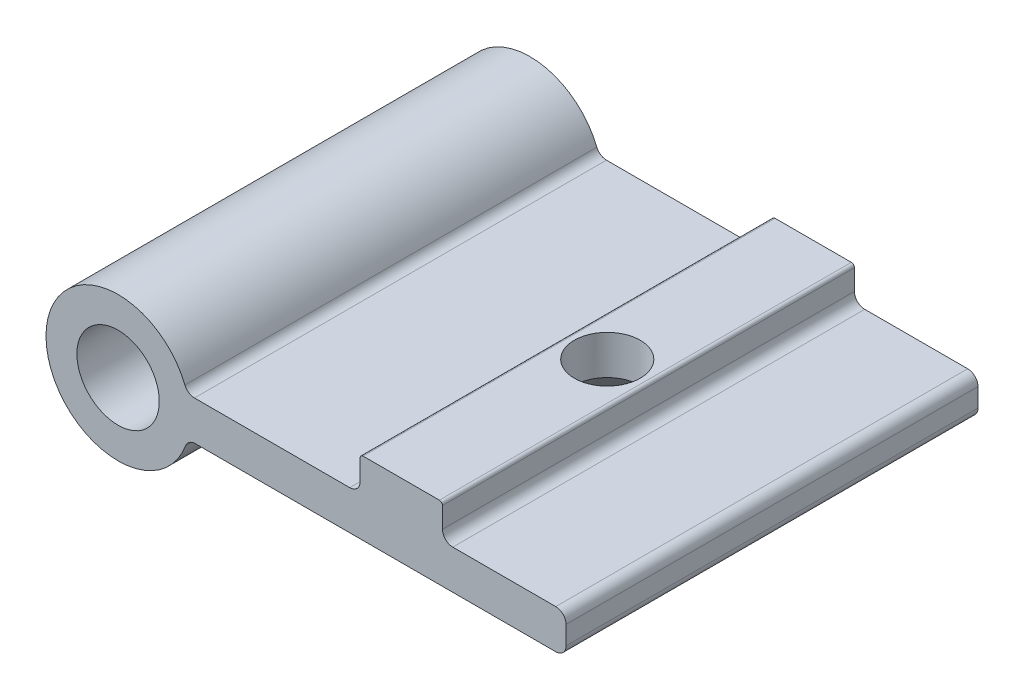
ISO-10303-21;
HEADER;
FILE_DESCRIPTION(('STEP AP214'),'2;1');
FILE_NAME('part.step','',(''),(''),'','','');
FILE_SCHEMA(('AUTOMOTIVE_DESIGN { 1 0 10303 214 1 1 1 1 }'));
ENDSEC;
DATA;
#1=APPLICATION_CONTEXT('core data for automotive mechanical design processes');
#2=APPLICATION_PROTOCOL_DEFINITION('international standard','automotive_design',2000,#1);
#3=PRODUCT_CONTEXT('',#1,'mechanical');
#4=PRODUCT('Part','Part','',(#3));
#5=PRODUCT_RELATED_PRODUCT_CATEGORY('part','',(#4));
#6=PRODUCT_DEFINITION_FORMATION('','',#4);
#7=PRODUCT_DEFINITION_CONTEXT('part definition',#1,'design');
#8=PRODUCT_DEFINITION('design','',#6,#7);
#9=PRODUCT_DEFINITION_SHAPE('','',#8);
#10=(LENGTH_UNIT() NAMED_UNIT(*) SI_UNIT(.MILLI.,.METRE.));
#11=(NAMED_UNIT(*) PLANE_ANGLE_UNIT() SI_UNIT($,.RADIAN.));
#12=(NAMED_UNIT(*) SI_UNIT($,.STERADIAN.) SOLID_ANGLE_UNIT());
#13=UNCERTAINTY_MEASURE_WITH_UNIT(LENGTH_MEASURE(1.E-05),#10,'distance_accuracy_value','');
#14=(GEOMETRIC_REPRESENTATION_CONTEXT(3) GLOBAL_UNCERTAINTY_ASSIGNED_CONTEXT((#13)) GLOBAL_UNIT_ASSIGNED_CONTEXT((#10,
#11,#12)) REPRESENTATION_CONTEXT('',''));
#15=CARTESIAN_POINT('',(0.,0.,0.));
#16=DIRECTION('',(0.,0.,1.));
#17=DIRECTION('',(1.,0.,0.));
#18=AXIS2_PLACEMENT_3D('',#15,#16,#17);
#19=CARTESIAN_POINT('',(31.2000000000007,5.00000000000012,20.));
#20=DIRECTION('',(0.,0.,-1.));
#21=DIRECTION('',(-1.,0.,0.));
#22=AXIS2_PLACEMENT_3D('',#19,#20,#21);
#23=CYLINDRICAL_SURFACE('',#22,0.299999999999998);
#24=CARTESIAN_POINT('',(31.2000000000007,5.00000000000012,20.));
#25=DIRECTION('',(0.,0.,-1.));
#26=DIRECTION('',(-1.,0.,0.));
#27=AXIS2_PLACEMENT_3D('',#24,#25,#26);
#28=CIRCLE('',#27,0.299999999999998);
#29=CARTESIAN_POINT('',(31.2000000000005,5.30000000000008,20.));
#30=VERTEX_POINT('',#29);
#31=CARTESIAN_POINT('',(31.5000000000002,5.00000000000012,20.0000000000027));
#32=VERTEX_POINT('',#31);
#33=EDGE_CURVE('E137',#30,#32,#28,.T.);
#34=ORIENTED_EDGE('',*,*,#33,.T.);
#35=DIRECTION('',(0.,0.,-1.));
#36=VECTOR('',#35,1.);
#37=CARTESIAN_POINT('',(31.5000000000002,5.00000000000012,20.0000000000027));
#38=LINE('',#37,#36);
#39=CARTESIAN_POINT('',(31.5000000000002,5.00000000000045,-19.9999999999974));
#40=VERTEX_POINT('',#39);
#41=EDGE_CURVE('E135',#40,#32,#38,.F.);
#42=ORIENTED_EDGE('',*,*,#41,.F.);
#43=CARTESIAN_POINT('',(31.2000000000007,5.00000000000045,-20.));
#44=DIRECTION('',(0.,0.,-1.));
#45=DIRECTION('',(-1.,0.,0.));
#46=AXIS2_PLACEMENT_3D('',#43,#44,#45);
#47=CIRCLE('',#46,0.299999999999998);
#48=CARTESIAN_POINT('',(31.2000000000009,5.30000000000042,-20.));
#49=VERTEX_POINT('',#48);
#50=EDGE_CURVE('E20',#40,#49,#47,.F.);
#51=ORIENTED_EDGE('',*,*,#50,.T.);
#52=DIRECTION('',(0.,0.,1.));
#53=VECTOR('',#52,1.);
#54=CARTESIAN_POINT('',(31.2000000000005,5.30000000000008,20.));
#55=LINE('',#54,#53);
#56=EDGE_CURVE('E132',#30,#49,#55,.F.);
#57=ORIENTED_EDGE('',*,*,#56,.F.);
#58=EDGE_LOOP('',(#34,#42,#51,#57));
#59=FACE_BOUND('',#58,.T.);
#60=ADVANCED_FACE('F16',(#59),#23,.T.);
#61=CARTESIAN_POINT('',(32.5000000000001,3.00000000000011,20.0000000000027));
#62=DIRECTION('',(0.,0.,-1.));
#63=DIRECTION('',(-1.,0.,0.));
#64=AXIS2_PLACEMENT_3D('',#61,#62,#63);
#65=CYLINDRICAL_SURFACE('',#64,0.999999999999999);
#66=CARTESIAN_POINT('',(32.5000000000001,3.00000000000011,20.0000000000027));
#67=DIRECTION('',(0.,0.,-1.));
#68=DIRECTION('',(-1.,0.,0.));
#69=AXIS2_PLACEMENT_3D('',#66,#67,#68);
#70=CIRCLE('',#69,0.999999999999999);
#71=CARTESIAN_POINT('',(31.4999999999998,3.00000000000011,20.0000000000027));
#72=VERTEX_POINT('',#71);
#73=CARTESIAN_POINT('',(32.5000000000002,2.00000000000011,20.0000000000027));
#74=VERTEX_POINT('',#73);
#75=EDGE_CURVE('E267',#72,#74,#70,.F.);
#76=ORIENTED_EDGE('',*,*,#75,.T.);
#77=DIRECTION('',(0.,0.,1.));
#78=VECTOR('',#77,1.);
#79=CARTESIAN_POINT('',(32.5000000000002,2.00000000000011,20.0000000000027));
#80=LINE('',#79,#78);
#81=CARTESIAN_POINT('',(32.5000000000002,2.00000000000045,-19.9999999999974));
#82=VERTEX_POINT('',#81);
#83=EDGE_CURVE('E218',#82,#74,#80,.T.);
#84=ORIENTED_EDGE('',*,*,#83,.F.);
#85=CARTESIAN_POINT('',(32.4999999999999,3.00000000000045,-19.9999999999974));
#86=DIRECTION('',(0.,0.,-1.));
#87=DIRECTION('',(-1.,0.,0.));
#88=AXIS2_PLACEMENT_3D('',#85,#86,#87);
#89=CIRCLE('',#88,0.999999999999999);
#90=CARTESIAN_POINT('',(31.4999999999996,3.00000000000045,-19.9999999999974));
#91=VERTEX_POINT('',#90);
#92=EDGE_CURVE('E269',#82,#91,#89,.T.);
#93=ORIENTED_EDGE('',*,*,#92,.T.);
#94=DIRECTION('',(0.,0.,-1.));
#95=VECTOR('',#94,1.);
#96=CARTESIAN_POINT('',(31.4999999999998,3.00000000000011,20.0000000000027));
#97=LINE('',#96,#95);
#98=EDGE_CURVE('E221',#72,#91,#97,.T.);
#99=ORIENTED_EDGE('',*,*,#98,.F.);
#100=EDGE_LOOP('',(#76,#84,#93,#99));
#101=FACE_BOUND('',#100,.T.);
#102=ADVANCED_FACE('F280',(#101),#65,.F.);
#103=CARTESIAN_POINT('',(42.5000000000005,1.00000000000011,20.0000000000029));
#104=DIRECTION('',(0.,0.,-1.));
#105=DIRECTION('',(-1.,0.,0.));
#106=AXIS2_PLACEMENT_3D('',#103,#104,#105);
#107=CYLINDRICAL_SURFACE('',#106,1.);
#108=CARTESIAN_POINT('',(42.5000000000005,1.00000000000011,20.0000000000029));
#109=DIRECTION('',(0.,0.,-1.));
#110=DIRECTION('',(-1.,0.,0.));
#111=AXIS2_PLACEMENT_3D('',#108,#109,#110);
#112=CIRCLE('',#111,1.);
#113=CARTESIAN_POINT('',(42.5,2.00000000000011,20.0000000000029));
#114=VERTEX_POINT('',#113);
#115=CARTESIAN_POINT('',(43.5000000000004,1.00000000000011,20.0000000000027));
#116=VERTEX_POINT('',#115);
#117=EDGE_CURVE('E263',#114,#116,#112,.T.);
#118=ORIENTED_EDGE('',*,*,#117,.T.);
#119=DIRECTION('',(0.,0.,-1.));
#120=VECTOR('',#119,1.);
#121=CARTESIAN_POINT('',(43.5000000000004,1.00000000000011,20.0000000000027));
#122=LINE('',#121,#120);
#123=CARTESIAN_POINT('',(43.5000000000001,1.00000000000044,-19.9999999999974));
#124=VERTEX_POINT('',#123);
#125=EDGE_CURVE('E205',#124,#116,#122,.F.);
#126=ORIENTED_EDGE('',*,*,#125,.F.);
#127=CARTESIAN_POINT('',(42.5000000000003,1.00000000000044,-19.9999999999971));
#128=DIRECTION('',(0.,0.,-1.));
#129=DIRECTION('',(-1.,0.,0.));
#130=AXIS2_PLACEMENT_3D('',#127,#128,#129);
#131=CIRCLE('',#130,1.);
#132=CARTESIAN_POINT('',(42.5,2.00000000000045,-19.9999999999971));
#133=VERTEX_POINT('',#132);
#134=EDGE_CURVE('E265',#124,#133,#131,.F.);
#135=ORIENTED_EDGE('',*,*,#134,.T.);
#136=DIRECTION('',(0.,0.,1.));
#137=VECTOR('',#136,1.);
#138=CARTESIAN_POINT('',(42.5,2.00000000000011,20.0000000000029));
#139=LINE('',#138,#137);
#140=EDGE_CURVE('E217',#114,#133,#139,.F.);
#141=ORIENTED_EDGE('',*,*,#140,.F.);
#142=EDGE_LOOP('',(#118,#126,#135,#141));
#143=FACE_BOUND('',#142,.T.);
#144=ADVANCED_FACE('F325',(#143),#107,.T.);
#145=CARTESIAN_POINT('',(22.4999999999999,3.00000000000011,20.0000000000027));
#146=DIRECTION('',(0.,0.,-1.));
#147=DIRECTION('',(-1.,0.,0.));
#148=AXIS2_PLACEMENT_3D('',#145,#146,#147);
#149=CYLINDRICAL_SURFACE('',#148,1.);
#150=CARTESIAN_POINT('',(22.4999999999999,3.00000000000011,20.0000000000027));
#151=DIRECTION('',(0.,0.,-1.));
#152=DIRECTION('',(-1.,0.,0.));
#153=AXIS2_PLACEMENT_3D('',#150,#151,#152);
#154=CIRCLE('',#153,1.);
#155=CARTESIAN_POINT('',(22.5,2.00000000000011,20.0000000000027));
#156=VERTEX_POINT('',#155);
#157=CARTESIAN_POINT('',(23.4999999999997,3.00000000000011,20.000000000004));
#158=VERTEX_POINT('',#157);
#159=EDGE_CURVE('E259',#156,#158,#154,.F.);
#160=ORIENTED_EDGE('',*,*,#159,.T.);
#161=DIRECTION('',(0.,0.,1.));
#162=VECTOR('',#161,1.);
#163=CARTESIAN_POINT('',(23.4999999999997,3.00000000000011,20.000000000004));
#164=LINE('',#163,#162);
#165=CARTESIAN_POINT('',(23.4999999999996,3.00000000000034,-19.999999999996));
#166=VERTEX_POINT('',#165);
#167=EDGE_CURVE('E194',#166,#158,#164,.T.);
#168=ORIENTED_EDGE('',*,*,#167,.F.);
#169=CARTESIAN_POINT('',(22.4999999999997,3.00000000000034,-19.9999999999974));
#170=DIRECTION('',(0.,0.,-1.));
#171=DIRECTION('',(-1.,0.,0.));
#172=AXIS2_PLACEMENT_3D('',#169,#170,#171);
#173=CIRCLE('',#172,1.);
#174=CARTESIAN_POINT('',(22.5,2.00000000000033,-19.9999999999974));
#175=VERTEX_POINT('',#174);
#176=EDGE_CURVE('E261',#166,#175,#173,.T.);
#177=ORIENTED_EDGE('',*,*,#176,.T.);
#178=DIRECTION('',(0.,0.,1.));
#179=VECTOR('',#178,1.);
#180=CARTESIAN_POINT('',(22.5,2.00000000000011,20.0000000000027));
#181=LINE('',#180,#179);
#182=EDGE_CURVE('E198',#156,#175,#181,.F.);
#183=ORIENTED_EDGE('',*,*,#182,.F.);
#184=EDGE_LOOP('',(#160,#168,#177,#183));
#185=FACE_BOUND('',#184,.T.);
#186=ADVANCED_FACE('F296',(#185),#149,.F.);
#187=CARTESIAN_POINT('',(23.8000000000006,5.,20.));
#188=DIRECTION('',(0.,0.,-1.));
#189=DIRECTION('',(-1.,0.,0.));
#190=AXIS2_PLACEMENT_3D('',#187,#188,#189);
#191=CYLINDRICAL_SURFACE('',#190,0.3);
#192=CARTESIAN_POINT('',(23.8000000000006,5.,20.));
#193=DIRECTION('',(0.,0.,-1.));
#194=DIRECTION('',(-1.,0.,0.));
#195=AXIS2_PLACEMENT_3D('',#192,#193,#194);
#196=CIRCLE('',#195,0.3);
#197=CARTESIAN_POINT('',(23.5000000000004,5.,20.0000000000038));
#198=VERTEX_POINT('',#197);
#199=CARTESIAN_POINT('',(23.8000000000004,5.30000000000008,20.));
#200=VERTEX_POINT('',#199);
#201=EDGE_CURVE('E256',#198,#200,#196,.T.);
#202=ORIENTED_EDGE('',*,*,#201,.T.);
#203=DIRECTION('',(0.,0.,1.));
#204=VECTOR('',#203,1.);
#205=CARTESIAN_POINT('',(23.8000000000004,5.30000000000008,20.));
#206=LINE('',#205,#204);
#207=CARTESIAN_POINT('',(23.8000000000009,5.30000000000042,-20.));
#208=VERTEX_POINT('',#207);
#209=EDGE_CURVE('E146',#208,#200,#206,.T.);
#210=ORIENTED_EDGE('',*,*,#209,.F.);
#211=CARTESIAN_POINT('',(23.8000000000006,5.00000000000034,-20.));
#212=DIRECTION('',(0.,0.,-1.));
#213=DIRECTION('',(-1.,0.,0.));
#214=AXIS2_PLACEMENT_3D('',#211,#212,#213);
#215=CIRCLE('',#214,0.3);
#216=CARTESIAN_POINT('',(23.5000000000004,5.00000000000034,-19.9999999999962));
#217=VERTEX_POINT('',#216);
#218=EDGE_CURVE('E152',#208,#217,#215,.F.);
#219=ORIENTED_EDGE('',*,*,#218,.T.);
#220=DIRECTION('',(0.,0.,1.));
#221=VECTOR('',#220,1.);
#222=CARTESIAN_POINT('',(23.5000000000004,5.,20.0000000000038));
#223=LINE('',#222,#221);
#224=EDGE_CURVE('E197',#198,#217,#223,.F.);
#225=ORIENTED_EDGE('',*,*,#224,.F.);
#226=EDGE_LOOP('',(#202,#210,#219,#225));
#227=FACE_BOUND('',#226,.T.);
#228=ADVANCED_FACE('F302',(#227),#191,.T.);
#229=CARTESIAN_POINT('',(7.4161984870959,3.00000000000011,20.0000000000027));
#230=DIRECTION('',(0.,0.,-1.));
#231=DIRECTION('',(-1.,0.,0.));
#232=AXIS2_PLACEMENT_3D('',#229,#230,#231);
#233=CYLINDRICAL_SURFACE('',#232,1.00000000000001);
#234=CARTESIAN_POINT('',(7.4161984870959,3.00000000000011,20.0000000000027));
#235=DIRECTION('',(0.,0.,-1.));
#236=DIRECTION('',(-1.,0.,0.));
#237=AXIS2_PLACEMENT_3D('',#234,#235,#236);
#238=CIRCLE('',#237,1.00000000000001);
#239=CARTESIAN_POINT('',(6.48917367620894,2.6250000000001,20.0000000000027));
#240=VERTEX_POINT('',#239);
#241=CARTESIAN_POINT('',(7.41619848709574,2.00000000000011,20.0000000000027));
#242=VERTEX_POINT('',#241);
#243=EDGE_CURVE('E252',#240,#242,#238,.F.);
#244=ORIENTED_EDGE('',*,*,#243,.T.);
#245=DIRECTION('',(0.,0.,1.));
#246=VECTOR('',#245,1.);
#247=CARTESIAN_POINT('',(7.41619848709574,2.00000000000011,20.0000000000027));
#248=LINE('',#247,#246);
#249=CARTESIAN_POINT('',(7.41619848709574,2.00000000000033,-19.9999999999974));
#250=VERTEX_POINT('',#249);
#251=EDGE_CURVE('E202',#250,#242,#248,.T.);
#252=ORIENTED_EDGE('',*,*,#251,.F.);
#253=CARTESIAN_POINT('',(7.4161984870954,3.00000000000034,-19.9999999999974));
#254=DIRECTION('',(0.,0.,-1.));
#255=DIRECTION('',(-1.,0.,0.));
#256=AXIS2_PLACEMENT_3D('',#253,#254,#255);
#257=CIRCLE('',#256,1.00000000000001);
#258=CARTESIAN_POINT('',(6.48917367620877,2.62500000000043,-19.9999999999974));
#259=VERTEX_POINT('',#258);
#260=EDGE_CURVE('E254',#250,#259,#257,.T.);
#261=ORIENTED_EDGE('',*,*,#260,.T.);
#262=DIRECTION('',(0.,0.,-1.));
#263=VECTOR('',#262,1.);
#264=CARTESIAN_POINT('',(6.48917367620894,2.6250000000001,20.0000000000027));
#265=LINE('',#264,#263);
#266=EDGE_CURVE('E201',#240,#259,#265,.T.);
#267=ORIENTED_EDGE('',*,*,#266,.F.);
#268=EDGE_LOOP('',(#244,#252,#261,#267));
#269=FACE_BOUND('',#268,.T.);
#270=ADVANCED_FACE('F306',(#269),#233,.F.);
#271=CARTESIAN_POINT('',(27.4999999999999,1.49999999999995,2.66453525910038E-12));
#272=DIRECTION('',(0.,1.,0.));
#273=DIRECTION('',(0.,0.,1.));
#274=AXIS2_PLACEMENT_3D('',#271,#272,#273);
#275=CYLINDRICAL_SURFACE('',#274,3.2);
#276=CARTESIAN_POINT('',(27.4999999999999,1.50000000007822,2.66453525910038E-12));
#277=DIRECTION('',(0.,-1.,0.));
#278=DIRECTION('',(1.,0.,0.));
#279=AXIS2_PLACEMENT_3D('',#276,#277,#278);
#280=CIRCLE('',#279,3.19999999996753);
#281=CARTESIAN_POINT('',(30.6999999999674,1.50000000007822,2.66453525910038E-12));
#282=VERTEX_POINT('',#281);
#283=EDGE_CURVE('E210',#282,#282,#280,.T.);
#284=ORIENTED_EDGE('',*,*,#283,.T.);
#285=EDGE_LOOP('',(#284));
#286=FACE_BOUND('',#285,.T.);
#287=CARTESIAN_POINT('',(27.5000000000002,5.30000000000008,1.99840144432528E-12));
#288=DIRECTION('',(0.,1.,0.));
#289=DIRECTION('',(0.,0.,1.));
#290=AXIS2_PLACEMENT_3D('',#287,#288,#289);
#291=CIRCLE('',#290,3.2);
#292=CARTESIAN_POINT('',(27.5000000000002,5.30000000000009,3.20000000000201));
#293=VERTEX_POINT('',#292);
#294=EDGE_CURVE('E227',#293,#293,#291,.F.);
#295=ORIENTED_EDGE('',*,*,#294,.F.);
#296=EDGE_LOOP('',(#295));
#297=FACE_BOUND('',#296,.T.);
#298=ADVANCED_FACE('F369',(#286,#297),#275,.F.);
#299=CARTESIAN_POINT('',(0.,0.,20.));
#300=DIRECTION('',(0.,0.,-1.));
#301=DIRECTION('',(-1.,0.,0.));
#302=AXIS2_PLACEMENT_3D('',#299,#300,#301);
#303=CYLINDRICAL_SURFACE('',#302,4.);
#304=CARTESIAN_POINT('',(0.,3.33066907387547E-13,-20.));
#305=DIRECTION('',(0.,0.,-1.));
#306=DIRECTION('',(-1.,0.,0.));
#307=AXIS2_PLACEMENT_3D('',#304,#305,#306);
#308=CIRCLE('',#307,4.);
#309=CARTESIAN_POINT('',(-4.,3.33066907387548E-13,-20.));
#310=VERTEX_POINT('',#309);
#311=EDGE_CURVE('E159',#310,#310,#308,.F.);
#312=ORIENTED_EDGE('',*,*,#311,.F.);
#313=EDGE_LOOP('',(#312));
#314=FACE_BOUND('',#313,.T.);
#315=CARTESIAN_POINT('',(0.,0.,20.));
#316=DIRECTION('',(0.,0.,-1.));
#317=DIRECTION('',(-1.,0.,0.));
#318=AXIS2_PLACEMENT_3D('',#315,#316,#317);
#319=CIRCLE('',#318,4.);
#320=CARTESIAN_POINT('',(-4.,0.,20.));
#321=VERTEX_POINT('',#320);
#322=EDGE_CURVE('E181',#321,#321,#319,.F.);
#323=ORIENTED_EDGE('',*,*,#322,.T.);
#324=EDGE_LOOP('',(#323));
#325=FACE_BOUND('',#324,.T.);
#326=ADVANCED_FACE('F366',(#314,#325),#303,.F.);
#327=CARTESIAN_POINT('',(31.2000000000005,5.30000000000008,20.));
#328=DIRECTION('',(0.,1.,0.));
#329=DIRECTION('',(0.,0.,1.));
#330=AXIS2_PLACEMENT_3D('',#327,#328,#329);
#331=PLANE('',#330);
#332=DIRECTION('',(-1.,0.,0.));
#333=VECTOR('',#332,1.);
#334=CARTESIAN_POINT('',(17.447513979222,5.29999999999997,20.000000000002));
#335=LINE('',#334,#333);
#336=EDGE_CURVE('E145',#200,#30,#335,.F.);
#337=ORIENTED_EDGE('',*,*,#336,.T.);
#338=ORIENTED_EDGE('',*,*,#56,.T.);
#339=DIRECTION('',(-1.,0.,0.));
#340=VECTOR('',#339,1.);
#341=CARTESIAN_POINT('',(17.4475139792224,5.3000000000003,-19.999999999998));
#342=LINE('',#341,#340);
#343=EDGE_CURVE('E143',#208,#49,#342,.F.);
#344=ORIENTED_EDGE('',*,*,#343,.F.);
#345=ORIENTED_EDGE('',*,*,#209,.T.);
#346=EDGE_LOOP('',(#337,#338,#344,#345));
#347=FACE_BOUND('',#346,.T.);
#348=ORIENTED_EDGE('',*,*,#294,.T.);
#349=EDGE_LOOP('',(#348));
#350=FACE_BOUND('',#349,.T.);
#351=ADVANCED_FACE('F140',(#347,#350),#331,.T.);
#352=CARTESIAN_POINT('',(31.4999999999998,3.00000000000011,20.0000000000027));
#353=DIRECTION('',(1.,0.,0.));
#354=DIRECTION('',(0.,0.,-1.));
#355=AXIS2_PLACEMENT_3D('',#352,#353,#354);
#356=PLANE('',#355);
#357=DIRECTION('',(0.,1.,0.));
#358=VECTOR('',#357,1.);
#359=CARTESIAN_POINT('',(31.5000000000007,0.454257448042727,20.0000000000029));
#360=LINE('',#359,#358);
#361=EDGE_CURVE('E177',#32,#72,#360,.F.);
#362=ORIENTED_EDGE('',*,*,#361,.T.);
#363=ORIENTED_EDGE('',*,*,#98,.T.);
#364=DIRECTION('',(0.,1.,0.));
#365=VECTOR('',#364,1.);
#366=CARTESIAN_POINT('',(31.4999999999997,0.454257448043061,-19.9999999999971));
#367=LINE('',#366,#365);
#368=EDGE_CURVE('E154',#40,#91,#367,.F.);
#369=ORIENTED_EDGE('',*,*,#368,.F.);
#370=ORIENTED_EDGE('',*,*,#41,.T.);
#371=EDGE_LOOP('',(#362,#363,#369,#370));
#372=FACE_BOUND('',#371,.T.);
#373=ADVANCED_FACE('F272',(#372),#356,.T.);
#374=CARTESIAN_POINT('',(42.5,2.00000000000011,20.0000000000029));
#375=DIRECTION('',(0.,1.,0.));
#376=DIRECTION('',(0.,0.,1.));
#377=AXIS2_PLACEMENT_3D('',#374,#375,#376);
#378=PLANE('',#377);
#379=DIRECTION('',(-1.,0.,0.));
#380=VECTOR('',#379,1.);
#381=CARTESIAN_POINT('',(17.4475139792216,2.00000000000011,20.0000000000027));
#382=LINE('',#381,#380);
#383=EDGE_CURVE('E174',#74,#114,#382,.F.);
#384=ORIENTED_EDGE('',*,*,#383,.T.);
#385=ORIENTED_EDGE('',*,*,#140,.T.);
#386=DIRECTION('',(-1.,0.,0.));
#387=VECTOR('',#386,1.);
#388=CARTESIAN_POINT('',(17.4475139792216,2.00000000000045,-19.9999999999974));
#389=LINE('',#388,#387);
#390=EDGE_CURVE('E157',#82,#133,#389,.F.);
#391=ORIENTED_EDGE('',*,*,#390,.F.);
#392=ORIENTED_EDGE('',*,*,#83,.T.);
#393=EDGE_LOOP('',(#384,#385,#391,#392));
#394=FACE_BOUND('',#393,.T.);
#395=ADVANCED_FACE('F284',(#394),#378,.T.);
#396=CARTESIAN_POINT('',(43.5,-0.799999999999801,20.0000000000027));
#397=DIRECTION('',(1.,0.,0.));
#398=DIRECTION('',(0.,0.,-1.));
#399=AXIS2_PLACEMENT_3D('',#396,#397,#398);
#400=PLANE('',#399);
#401=DIRECTION('',(0.,1.,0.));
#402=VECTOR('',#401,1.);
#403=CARTESIAN_POINT('',(43.5000000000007,0.454257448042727,20.0000000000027));
#404=LINE('',#403,#402);
#405=CARTESIAN_POINT('',(43.5,-0.799999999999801,20.0000000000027));
#406=VERTEX_POINT('',#405);
#407=EDGE_CURVE('E171',#116,#406,#404,.F.);
#408=ORIENTED_EDGE('',*,*,#407,.T.);
#409=DIRECTION('',(0.,0.,-1.));
#410=VECTOR('',#409,1.);
#411=CARTESIAN_POINT('',(43.5,-0.799999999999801,20.0000000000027));
#412=LINE('',#411,#410);
#413=CARTESIAN_POINT('',(43.4999999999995,-0.799999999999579,-19.9999999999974));
#414=VERTEX_POINT('',#413);
#415=EDGE_CURVE('E211',#414,#406,#412,.F.);
#416=ORIENTED_EDGE('',*,*,#415,.F.);
#417=DIRECTION('',(0.,1.,0.));
#418=VECTOR('',#417,1.);
#419=CARTESIAN_POINT('',(43.4999999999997,0.454257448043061,-19.9999999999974));
#420=LINE('',#419,#418);
#421=EDGE_CURVE('E247',#124,#414,#420,.F.);
#422=ORIENTED_EDGE('',*,*,#421,.F.);
#423=ORIENTED_EDGE('',*,*,#125,.T.);
#424=EDGE_LOOP('',(#408,#416,#422,#423));
#425=FACE_BOUND('',#424,.T.);
#426=ADVANCED_FACE('F322',(#425),#400,.T.);
#427=CARTESIAN_POINT('',(22.5,2.00000000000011,20.0000000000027));
#428=DIRECTION('',(0.,1.,0.));
#429=DIRECTION('',(0.,0.,1.));
#430=AXIS2_PLACEMENT_3D('',#427,#428,#429);
#431=PLANE('',#430);
#432=DIRECTION('',(-1.,0.,0.));
#433=VECTOR('',#432,1.);
#434=CARTESIAN_POINT('',(17.4475139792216,2.00000000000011,20.0000000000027));
#435=LINE('',#434,#433);
#436=EDGE_CURVE('E167',#242,#156,#435,.F.);
#437=ORIENTED_EDGE('',*,*,#436,.T.);
#438=ORIENTED_EDGE('',*,*,#182,.T.);
#439=DIRECTION('',(-1.,0.,0.));
#440=VECTOR('',#439,1.);
#441=CARTESIAN_POINT('',(17.4475139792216,2.00000000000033,-19.9999999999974));
#442=LINE('',#441,#440);
#443=EDGE_CURVE('E243',#250,#175,#442,.F.);
#444=ORIENTED_EDGE('',*,*,#443,.F.);
#445=ORIENTED_EDGE('',*,*,#251,.T.);
#446=EDGE_LOOP('',(#437,#438,#444,#445));
#447=FACE_BOUND('',#446,.T.);
#448=ADVANCED_FACE('F292',(#447),#431,.T.);
#449=CARTESIAN_POINT('',(23.5000000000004,5.,20.0000000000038));
#450=DIRECTION('',(-1.,0.,0.));
#451=DIRECTION('',(0.,0.,1.));
#452=AXIS2_PLACEMENT_3D('',#449,#450,#451);
#453=PLANE('',#452);
#454=DIRECTION('',(0.,1.,0.));
#455=VECTOR('',#454,1.);
#456=CARTESIAN_POINT('',(23.5000000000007,0.454257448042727,20.0000000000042));
#457=LINE('',#456,#455);
#458=EDGE_CURVE('E163',#158,#198,#457,.T.);
#459=ORIENTED_EDGE('',*,*,#458,.T.);
#460=ORIENTED_EDGE('',*,*,#224,.T.);
#461=DIRECTION('',(0.,1.,0.));
#462=VECTOR('',#461,1.);
#463=CARTESIAN_POINT('',(23.4999999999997,0.454257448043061,-19.9999999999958));
#464=LINE('',#463,#462);
#465=EDGE_CURVE('E155',#166,#217,#464,.T.);
#466=ORIENTED_EDGE('',*,*,#465,.F.);
#467=ORIENTED_EDGE('',*,*,#167,.T.);
#468=EDGE_LOOP('',(#459,#460,#466,#467));
#469=FACE_BOUND('',#468,.T.);
#470=ADVANCED_FACE('F299',(#469),#453,.T.);
#471=CARTESIAN_POINT('',(0.,1.11022302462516E-13,20.));
#472=DIRECTION('',(0.,0.,-1.));
#473=DIRECTION('',(-1.,0.,0.));
#474=AXIS2_PLACEMENT_3D('',#471,#472,#473);
#475=CYLINDRICAL_SURFACE('',#474,7.);
#476=CARTESIAN_POINT('',(0.,1.11022302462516E-13,20.));
#477=DIRECTION('',(0.,0.,-1.));
#478=DIRECTION('',(-1.,0.,0.));
#479=AXIS2_PLACEMENT_3D('',#476,#477,#478);
#480=CIRCLE('',#479,7.);
#481=CARTESIAN_POINT('',(6.55724789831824,-2.44999999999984,20.0000000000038));
#482=VERTEX_POINT('',#481);
#483=EDGE_CURVE('E170',#482,#240,#480,.T.);
#484=ORIENTED_EDGE('',*,*,#483,.T.);
#485=ORIENTED_EDGE('',*,*,#266,.T.);
#486=CARTESIAN_POINT('',(0.,4.44089209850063E-13,-20.));
#487=DIRECTION('',(0.,0.,-1.));
#488=DIRECTION('',(-1.,0.,0.));
#489=AXIS2_PLACEMENT_3D('',#486,#487,#488);
#490=CIRCLE('',#489,7.);
#491=CARTESIAN_POINT('',(6.55724789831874,-2.44999999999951,-19.9999999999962));
#492=VERTEX_POINT('',#491);
#493=EDGE_CURVE('E244',#492,#259,#490,.T.);
#494=ORIENTED_EDGE('',*,*,#493,.F.);
#495=DIRECTION('',(0.,0.,-1.));
#496=VECTOR('',#495,1.);
#497=CARTESIAN_POINT('',(6.55724789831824,-2.44999999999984,20.0000000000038));
#498=LINE('',#497,#496);
#499=EDGE_CURVE('E191',#482,#492,#498,.T.);
#500=ORIENTED_EDGE('',*,*,#499,.F.);
#501=EDGE_LOOP('',(#484,#485,#494,#500));
#502=FACE_BOUND('',#501,.T.);
#503=ADVANCED_FACE('F308',(#502),#475,.T.);
#504=CARTESIAN_POINT('',(27.4999999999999,-1.79999999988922,2.66453525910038E-12));
#505=DIRECTION('',(0.,-1.,0.));
#506=DIRECTION('',(0.,0.,-1.));
#507=AXIS2_PLACEMENT_3D('',#504,#505,#506);
#508=CONICAL_SURFACE('',#507,6.49999999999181,0.785398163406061);
#509=CARTESIAN_POINT('',(27.4999999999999,-1.79999999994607,2.66453525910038E-12));
#510=DIRECTION('',(0.,-1.,0.));
#511=DIRECTION('',(0.,0.,-1.));
#512=AXIS2_PLACEMENT_3D('',#509,#510,#511);
#513=CIRCLE('',#512,6.50000000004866);
#514=CARTESIAN_POINT('',(27.4999999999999,-1.79999999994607,-6.500000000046));
#515=VERTEX_POINT('',#514);
#516=EDGE_CURVE('E190',#515,#515,#513,.F.);
#517=ORIENTED_EDGE('',*,*,#516,.F.);
#518=EDGE_LOOP('',(#517));
#519=FACE_BOUND('',#518,.T.);
#520=ORIENTED_EDGE('',*,*,#283,.F.);
#521=EDGE_LOOP('',(#520));
#522=FACE_BOUND('',#521,.T.);
#523=ADVANCED_FACE('F348',(#519,#522),#508,.F.);
#524=CARTESIAN_POINT('',(17.4475139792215,0.454257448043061,-19.9999999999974));
#525=DIRECTION('',(0.,0.,-1.));
#526=DIRECTION('',(-1.,0.,0.));
#527=AXIS2_PLACEMENT_3D('',#524,#525,#526);
#528=PLANE('',#527);
#529=ORIENTED_EDGE('',*,*,#443,.T.);
#530=ORIENTED_EDGE('',*,*,#176,.F.);
#531=ORIENTED_EDGE('',*,*,#465,.T.);
#532=ORIENTED_EDGE('',*,*,#218,.F.);
#533=ORIENTED_EDGE('',*,*,#343,.T.);
#534=ORIENTED_EDGE('',*,*,#50,.F.);
#535=ORIENTED_EDGE('',*,*,#368,.T.);
#536=ORIENTED_EDGE('',*,*,#92,.F.);
#537=ORIENTED_EDGE('',*,*,#390,.T.);
#538=ORIENTED_EDGE('',*,*,#134,.F.);
#539=ORIENTED_EDGE('',*,*,#421,.T.);
#540=CARTESIAN_POINT('',(42.4999999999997,-0.799999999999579,-19.9999999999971));
#541=DIRECTION('',(0.,0.,-1.));
#542=DIRECTION('',(-1.,0.,0.));
#543=AXIS2_PLACEMENT_3D('',#540,#541,#542);
#544=CIRCLE('',#543,0.999999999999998);
#545=CARTESIAN_POINT('',(42.4999999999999,-1.79999999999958,-19.9999999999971));
#546=VERTEX_POINT('',#545);
#547=EDGE_CURVE('E214',#546,#414,#544,.F.);
#548=ORIENTED_EDGE('',*,*,#547,.F.);
#549=DIRECTION('',(1.,0.,0.));
#550=VECTOR('',#549,1.);
#551=CARTESIAN_POINT('',(7.49399759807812,-1.79999999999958,-19.9999999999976));
#552=LINE('',#551,#550);
#553=CARTESIAN_POINT('',(7.49399759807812,-1.79999999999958,-19.9999999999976));
#554=VERTEX_POINT('',#553);
#555=EDGE_CURVE('E185',#554,#546,#552,.T.);
#556=ORIENTED_EDGE('',*,*,#555,.F.);
#557=CARTESIAN_POINT('',(7.49399759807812,-2.79999999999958,-19.9999999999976));
#558=DIRECTION('',(0.,0.,-1.));
#559=DIRECTION('',(-1.,0.,0.));
#560=AXIS2_PLACEMENT_3D('',#557,#558,#559);
#561=CIRCLE('',#560,0.999999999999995);
#562=EDGE_CURVE('E166',#492,#554,#561,.T.);
#563=ORIENTED_EDGE('',*,*,#562,.F.);
#564=ORIENTED_EDGE('',*,*,#493,.T.);
#565=ORIENTED_EDGE('',*,*,#260,.F.);
#566=EDGE_LOOP('',(#529,#530,#531,#532,#533,#534,#535,#536,#537,#538,#539,#548,#556,#563,#564,#565));
#567=FACE_BOUND('',#566,.T.);
#568=ORIENTED_EDGE('',*,*,#311,.T.);
#569=EDGE_LOOP('',(#568));
#570=FACE_BOUND('',#569,.T.);
#571=ADVANCED_FACE('F149',(#567,#570),#528,.T.);
#572=CARTESIAN_POINT('',(42.5000000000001,-0.799999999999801,20.0000000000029));
#573=DIRECTION('',(0.,0.,-1.));
#574=DIRECTION('',(-1.,0.,0.));
#575=AXIS2_PLACEMENT_3D('',#572,#573,#574);
#576=CYLINDRICAL_SURFACE('',#575,0.999999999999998);
#577=CARTESIAN_POINT('',(42.5000000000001,-0.799999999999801,20.0000000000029));
#578=DIRECTION('',(0.,0.,-1.));
#579=DIRECTION('',(-1.,0.,0.));
#580=AXIS2_PLACEMENT_3D('',#577,#578,#579);
#581=CIRCLE('',#580,0.999999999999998);
#582=CARTESIAN_POINT('',(42.4999999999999,-1.7999999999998,20.0000000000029));
#583=VERTEX_POINT('',#582);
#584=EDGE_CURVE('E173',#406,#583,#581,.T.);
#585=ORIENTED_EDGE('',*,*,#584,.T.);
#586=DIRECTION('',(0.,0.,-1.));
#587=VECTOR('',#586,1.);
#588=CARTESIAN_POINT('',(42.4999999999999,-1.7999999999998,20.0000000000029));
#589=LINE('',#588,#587);
#590=EDGE_CURVE('E182',#546,#583,#589,.F.);
#591=ORIENTED_EDGE('',*,*,#590,.F.);
#592=ORIENTED_EDGE('',*,*,#547,.T.);
#593=ORIENTED_EDGE('',*,*,#415,.T.);
#594=EDGE_LOOP('',(#585,#591,#592,#593));
#595=FACE_BOUND('',#594,.T.);
#596=ADVANCED_FACE('F318',(#595),#576,.T.);
#597=CARTESIAN_POINT('',(17.4475139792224,0.454257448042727,20.0000000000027));
#598=DIRECTION('',(0.,0.,-1.));
#599=DIRECTION('',(-1.,0.,0.));
#600=AXIS2_PLACEMENT_3D('',#597,#598,#599);
#601=PLANE('',#600);
#602=ORIENTED_EDGE('',*,*,#458,.F.);
#603=ORIENTED_EDGE('',*,*,#159,.F.);
#604=ORIENTED_EDGE('',*,*,#436,.F.);
#605=ORIENTED_EDGE('',*,*,#243,.F.);
#606=ORIENTED_EDGE('',*,*,#483,.F.);
#607=CARTESIAN_POINT('',(7.49399759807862,-2.7999999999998,20.0000000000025));
#608=DIRECTION('',(0.,0.,-1.));
#609=DIRECTION('',(-1.,0.,0.));
#610=AXIS2_PLACEMENT_3D('',#607,#608,#609);
#611=CIRCLE('',#610,0.999999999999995);
#612=CARTESIAN_POINT('',(7.49399759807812,-1.7999999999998,20.0000000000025));
#613=VERTEX_POINT('',#612);
#614=EDGE_CURVE('E35',#613,#482,#611,.F.);
#615=ORIENTED_EDGE('',*,*,#614,.F.);
#616=DIRECTION('',(1.,0.,0.));
#617=VECTOR('',#616,1.);
#618=CARTESIAN_POINT('',(7.49399759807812,-1.7999999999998,20.0000000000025));
#619=LINE('',#618,#617);
#620=EDGE_CURVE('E26',#583,#613,#619,.F.);
#621=ORIENTED_EDGE('',*,*,#620,.F.);
#622=ORIENTED_EDGE('',*,*,#584,.F.);
#623=ORIENTED_EDGE('',*,*,#407,.F.);
#624=ORIENTED_EDGE('',*,*,#117,.F.);
#625=ORIENTED_EDGE('',*,*,#383,.F.);
#626=ORIENTED_EDGE('',*,*,#75,.F.);
#627=ORIENTED_EDGE('',*,*,#361,.F.);
#628=ORIENTED_EDGE('',*,*,#33,.F.);
#629=ORIENTED_EDGE('',*,*,#336,.F.);
#630=ORIENTED_EDGE('',*,*,#201,.F.);
#631=EDGE_LOOP('',(#602,#603,#604,#605,#606,#615,#621,#622,#623,#624,#625,#626,#627,#628,#629,#630));
#632=FACE_BOUND('',#631,.T.);
#633=ORIENTED_EDGE('',*,*,#322,.F.);
#634=EDGE_LOOP('',(#633));
#635=FACE_BOUND('',#634,.T.);
#636=ADVANCED_FACE('F274',(#632,#635),#601,.F.);
#637=CARTESIAN_POINT('',(7.49399759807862,-2.7999999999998,20.0000000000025));
#638=DIRECTION('',(0.,0.,-1.));
#639=DIRECTION('',(-1.,0.,0.));
#640=AXIS2_PLACEMENT_3D('',#637,#638,#639);
#641=CYLINDRICAL_SURFACE('',#640,0.999999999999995);
#642=ORIENTED_EDGE('',*,*,#614,.T.);
#643=ORIENTED_EDGE('',*,*,#499,.T.);
#644=ORIENTED_EDGE('',*,*,#562,.T.);
#645=DIRECTION('',(0.,0.,-1.));
#646=VECTOR('',#645,1.);
#647=CARTESIAN_POINT('',(7.49399759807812,-1.7999999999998,20.0000000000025));
#648=LINE('',#647,#646);
#649=EDGE_CURVE('E11',#613,#554,#648,.T.);
#650=ORIENTED_EDGE('',*,*,#649,.F.);
#651=EDGE_LOOP('',(#642,#643,#644,#650));
#652=FACE_BOUND('',#651,.T.);
#653=ADVANCED_FACE('F311',(#652),#641,.F.);
#654=CARTESIAN_POINT('',(7.49399759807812,-1.7999999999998,20.0000000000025));
#655=DIRECTION('',(0.,-1.,0.));
#656=DIRECTION('',(0.,0.,-1.));
#657=AXIS2_PLACEMENT_3D('',#654,#655,#656);
#658=PLANE('',#657);
#659=ORIENTED_EDGE('',*,*,#620,.T.);
#660=ORIENTED_EDGE('',*,*,#649,.T.);
#661=ORIENTED_EDGE('',*,*,#555,.T.);
#662=ORIENTED_EDGE('',*,*,#590,.T.);
#663=EDGE_LOOP('',(#659,#660,#661,#662));
#664=FACE_BOUND('',#663,.T.);
#665=ORIENTED_EDGE('',*,*,#516,.T.);
#666=EDGE_LOOP('',(#665));
#667=FACE_BOUND('',#666,.T.);
#668=ADVANCED_FACE('F18',(#664,#667),#658,.T.);
#669=CLOSED_SHELL('',(#60,#102,#144,#186,#228,#270,#298,#326,#351,#373,#395,#426,#448,#470,#503,
#523,#571,#596,#636,#653,#668));
#670=MANIFOLD_SOLID_BREP('B1',#669);
#671=ADVANCED_BREP_SHAPE_REPRESENTATION('',(#18,#670),#14);
#672=SHAPE_DEFINITION_REPRESENTATION(#9,#671);
ENDSEC;
END-ISO-10303-21;
